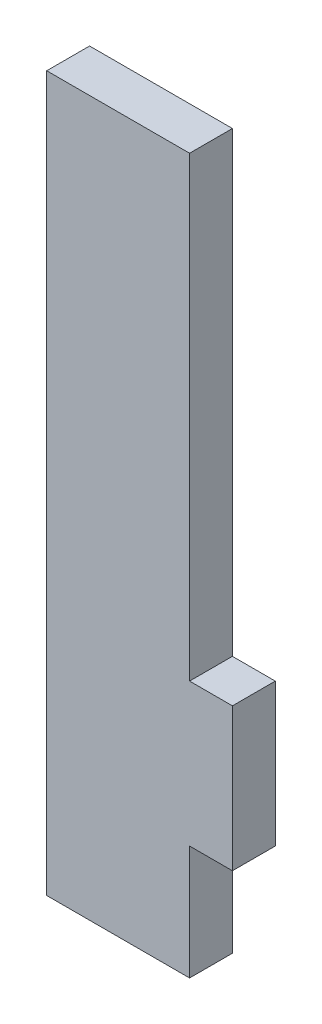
from build123d import *

# Parameters (mm, degrees)
BOSS_EXTRU_1_DEPTH = 3
ESQUISSE2_W        = 10
ESQUISSE2_H        = 3
BOSS_EXTRU_2_DEPTH = 5


with BuildPart() as part:
    # Esquisse1 → Boss.-Extru.1 (new body)
    with BuildSketch(Plane.XY):
        Polygon((0, 0), (10, 0), (10, 3), (13, 3), (13, 13), (10, 13), (10, 45), (0, 45), align=None)
    extrude(amount=BOSS_EXTRU_1_DEPTH)

    # Esquisse2 → Boss.-Extru.2 (add)
    with BuildSketch(Plane.XZ):
        with Locations((5, 1.5)):
            Rectangle(ESQUISSE2_W, ESQUISSE2_H)
    extrude(amount=BOSS_EXTRU_2_DEPTH)


solid = part.part
